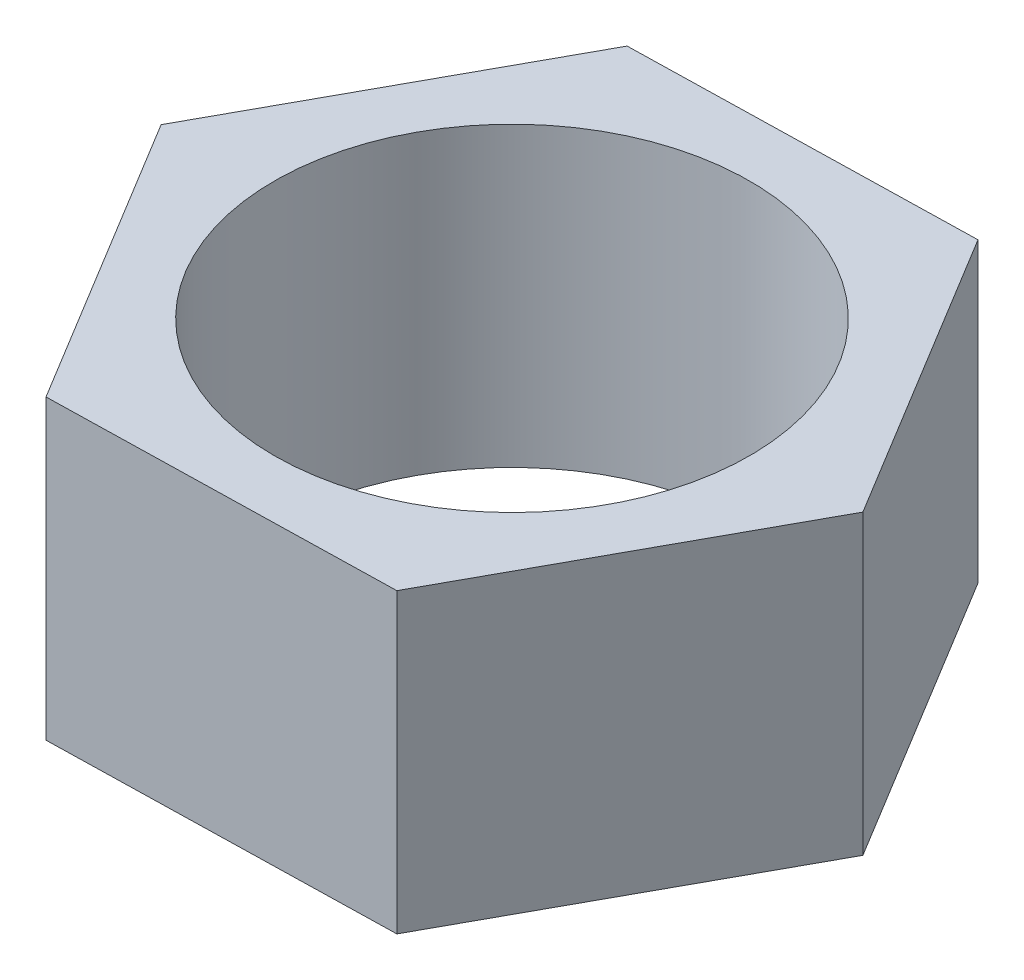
from build123d import *

# Parameters (mm, degrees)
BOSS_EXTRUDE1_DEPTH = 5
SKETCH2_R           = 4
CUT_EXTRUDE1_DEPTH  = 14


with BuildPart() as part:
    # Sketch1 → Boss-Extrude1 (new body)
    with BuildSketch(Plane(origin=(0, 0, 0), x_dir=(1, 0, 0), z_dir=(0, 1, 0))):
        Polygon((2.997951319, -4.934128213), (5.772056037, 0.129237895), (2.774104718, 5.063366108), (-2.997951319, 4.934128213), (-5.772056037, -0.129237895), (-2.774104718, -5.063366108), align=None)
    extrude(amount=BOSS_EXTRUDE1_DEPTH)

    # Sketch2 → Cut-Extrude1 (cut)
    with BuildSketch(Plane(origin=(0, 5, 0), x_dir=(1, 0, 0), z_dir=(0, 1, 0))):
        with Locations(Location((0, 0, 0), (0, 0, 270))):
            Circle(SKETCH2_R)
    extrude(amount=-CUT_EXTRUDE1_DEPTH, mode=Mode.SUBTRACT)


solid = part.part
